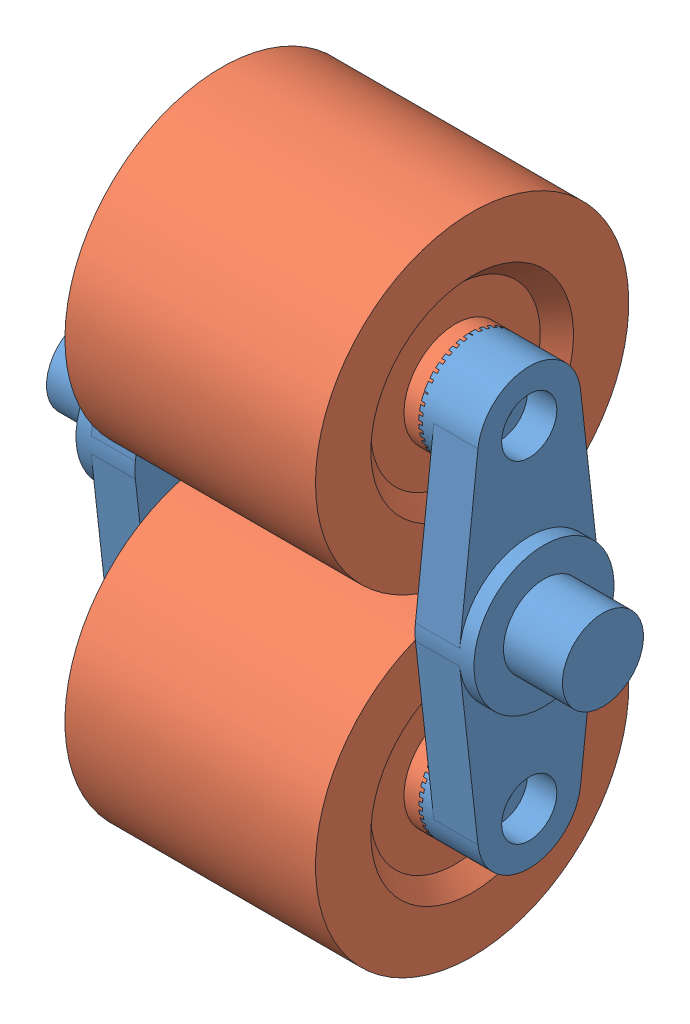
SolidWorks assembly bogie.SLDASM, configuration Défaut (file format 3100). Lengths in mm.
Overall size (140 205.56 120.09).
4 component instances, 2 part files, 6 mates.
Components (placement in the parent):
- 2-levier-1: 2-levier.SLDPRT [Défaut] at (21.7226 159.6891 36.1684) x (0 1 0) z (-1 0 0) size (118 38 36)
- 2-levier-2: 2-levier.SLDPRT [Défaut] at (-78.2774 159.6891 36.1684) x (0 -1 0) z (1 0 0) size (118 38 36)
- 1-Rouleau-1: 1-Rouleau.SLDPRT [Défaut] at (-27.7774 204.6891 36.1684) x (1 0 0) z (0 0.737208 -0.675666) size (69 85 85)
- 1-Rouleau-2: 1-Rouleau.SLDPRT [Défaut] at (-27.7774 114.6891 36.1684) x (1 0 0) z (0 0.381849 0.924225) size (69 85 85)
Mates (geometry in assembly coordinates):
- Coaxial5: concentric anti-aligned: cylinder of 2-levier-2; cylinder of 1-Rouleau-1
- Coïncidente5: coincident anti-aligned: plane of 2-levier-2 through (-62.2774 204.6891 36.1684) normal (1 0 0); plane of 1-Rouleau-1 through (-62.2774 201.9865 33.2196) normal (-1 0 0)
- Coaxial6: concentric anti-aligned: cylinder of 2-levier-2; cylinder of 1-Rouleau-2
- Coïncidente6: coincident anti-aligned: plane of 2-levier-2 through (-62.2774 114.6891 36.1684) normal (1 0 0); plane of 1-Rouleau-2 through (-62.2774 118.386 34.641) normal (-1 0 0)
- Coaxial12: concentric anti-aligned: cylinder of 2-levier-1; cylinder of 1-Rouleau-2
- Coaxial13: concentric aligned: unknown of 2-levier-1; unknown of 1-Rouleau-1
